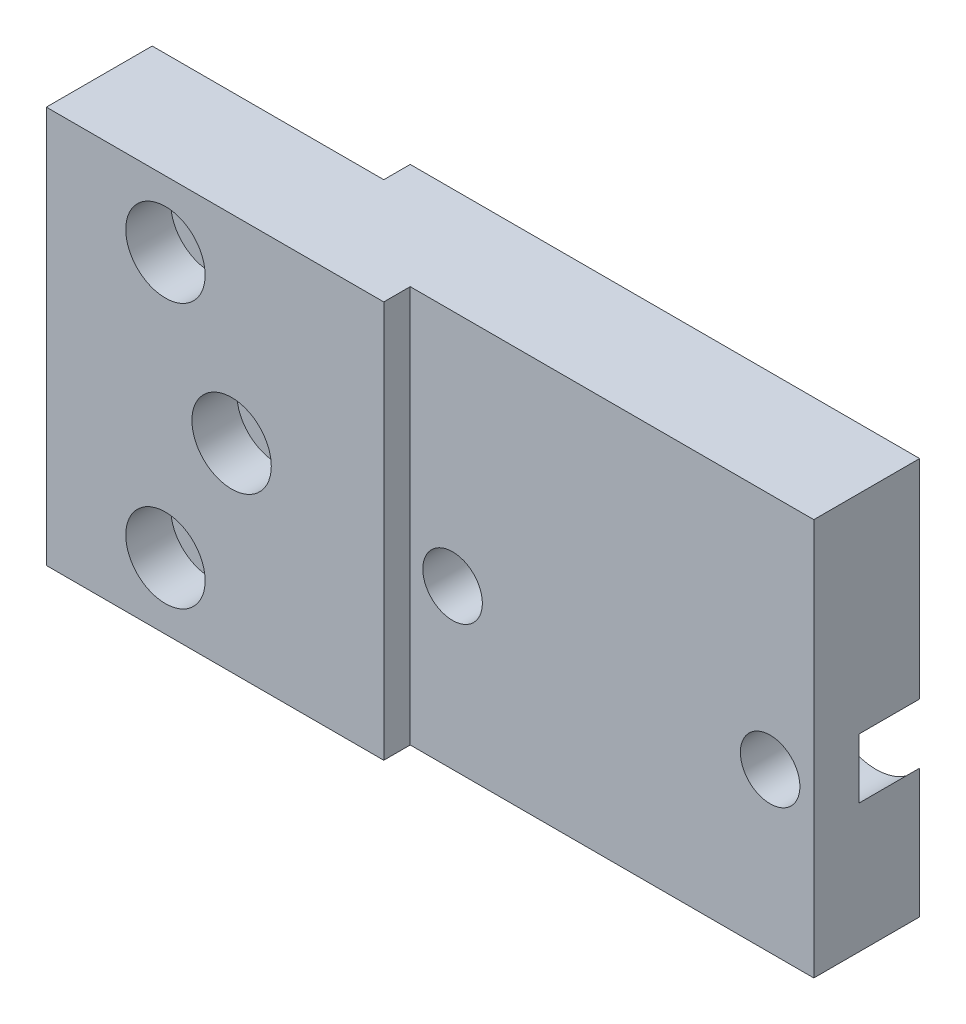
ISO-10303-21;
HEADER;
FILE_DESCRIPTION(('STEP AP214'),'2;1');
FILE_NAME('part.step','',(''),(''),'','','');
FILE_SCHEMA(('AUTOMOTIVE_DESIGN { 1 0 10303 214 1 1 1 1 }'));
ENDSEC;
DATA;
#1=APPLICATION_CONTEXT('core data for automotive mechanical design processes');
#2=APPLICATION_PROTOCOL_DEFINITION('international standard','automotive_design',2000,#1);
#3=PRODUCT_CONTEXT('',#1,'mechanical');
#4=PRODUCT('Part','Part','',(#3));
#5=PRODUCT_RELATED_PRODUCT_CATEGORY('part','',(#4));
#6=PRODUCT_DEFINITION_FORMATION('','',#4);
#7=PRODUCT_DEFINITION_CONTEXT('part definition',#1,'design');
#8=PRODUCT_DEFINITION('design','',#6,#7);
#9=PRODUCT_DEFINITION_SHAPE('','',#8);
#10=(LENGTH_UNIT() NAMED_UNIT(*) SI_UNIT(.MILLI.,.METRE.));
#11=(NAMED_UNIT(*) PLANE_ANGLE_UNIT() SI_UNIT($,.RADIAN.));
#12=(NAMED_UNIT(*) SI_UNIT($,.STERADIAN.) SOLID_ANGLE_UNIT());
#13=UNCERTAINTY_MEASURE_WITH_UNIT(LENGTH_MEASURE(1.E-05),#10,'distance_accuracy_value','');
#14=(GEOMETRIC_REPRESENTATION_CONTEXT(3) GLOBAL_UNCERTAINTY_ASSIGNED_CONTEXT((#13)) GLOBAL_UNIT_ASSIGNED_CONTEXT((#10,
#11,#12)) REPRESENTATION_CONTEXT('',''));
#15=CARTESIAN_POINT('',(0.,0.,0.));
#16=DIRECTION('',(0.,0.,1.));
#17=DIRECTION('',(1.,0.,0.));
#18=AXIS2_PLACEMENT_3D('',#15,#16,#17);
#19=CARTESIAN_POINT('',(-3.2,-15.,10.));
#20=DIRECTION('',(1.,0.,0.));
#21=DIRECTION('',(0.,0.,-1.));
#22=AXIS2_PLACEMENT_3D('',#19,#20,#21);
#23=PLANE('',#22);
#24=DIRECTION('',(0.,0.,-1.));
#25=VECTOR('',#24,1.);
#26=CARTESIAN_POINT('',(-3.2,15.,10.));
#27=LINE('',#26,#25);
#28=CARTESIAN_POINT('',(-3.2,15.,10.));
#29=VERTEX_POINT('',#28);
#30=CARTESIAN_POINT('',(-3.2,15.,2.));
#31=VERTEX_POINT('',#30);
#32=EDGE_CURVE('E200',#29,#31,#27,.T.);
#33=ORIENTED_EDGE('',*,*,#32,.T.);
#34=DIRECTION('',(0.,1.,0.));
#35=VECTOR('',#34,1.);
#36=CARTESIAN_POINT('',(-3.2,-15.,2.));
#37=LINE('',#36,#35);
#38=CARTESIAN_POINT('',(-3.2,-15.,2.));
#39=VERTEX_POINT('',#38);
#40=EDGE_CURVE('E180',#39,#31,#37,.T.);
#41=ORIENTED_EDGE('',*,*,#40,.F.);
#42=DIRECTION('',(0.,0.,-1.));
#43=VECTOR('',#42,1.);
#44=CARTESIAN_POINT('',(-3.2,-15.,10.));
#45=LINE('',#44,#43);
#46=CARTESIAN_POINT('',(-3.2,-15.,10.));
#47=VERTEX_POINT('',#46);
#48=EDGE_CURVE('E215',#47,#39,#45,.T.);
#49=ORIENTED_EDGE('',*,*,#48,.F.);
#50=DIRECTION('',(0.,-1.,0.));
#51=VECTOR('',#50,1.);
#52=CARTESIAN_POINT('',(-3.2,-15.,10.));
#53=LINE('',#52,#51);
#54=EDGE_CURVE('E192',#29,#47,#53,.T.);
#55=ORIENTED_EDGE('',*,*,#54,.F.);
#56=EDGE_LOOP('',(#33,#41,#49,#55));
#57=FACE_BOUND('',#56,.T.);
#58=ADVANCED_FACE('F16',(#57),#23,.F.);
#59=CARTESIAN_POINT('',(-3.2,-15.,10.));
#60=DIRECTION('',(0.,1.,0.));
#61=DIRECTION('',(0.,0.,1.));
#62=AXIS2_PLACEMENT_3D('',#59,#60,#61);
#63=PLANE('',#62);
#64=DIRECTION('',(0.,0.,-1.));
#65=VECTOR('',#64,1.);
#66=CARTESIAN_POINT('',(52.8,-15.,10.));
#67=LINE('',#66,#65);
#68=CARTESIAN_POINT('',(52.8,-15.,8.));
#69=VERTEX_POINT('',#68);
#70=CARTESIAN_POINT('',(52.8,-15.,0.));
#71=VERTEX_POINT('',#70);
#72=EDGE_CURVE('E213',#69,#71,#67,.T.);
#73=ORIENTED_EDGE('',*,*,#72,.F.);
#74=DIRECTION('',(1.,0.,0.));
#75=VECTOR('',#74,1.);
#76=CARTESIAN_POINT('',(52.8,-15.,8.));
#77=LINE('',#76,#75);
#78=CARTESIAN_POINT('',(22.3,-15.,8.));
#79=VERTEX_POINT('',#78);
#80=EDGE_CURVE('E114',#79,#69,#77,.T.);
#81=ORIENTED_EDGE('',*,*,#80,.F.);
#82=DIRECTION('',(0.,0.,-1.));
#83=VECTOR('',#82,1.);
#84=CARTESIAN_POINT('',(22.3,-15.,10.));
#85=LINE('',#84,#83);
#86=CARTESIAN_POINT('',(22.3,-15.,10.));
#87=VERTEX_POINT('',#86);
#88=EDGE_CURVE('E96',#87,#79,#85,.T.);
#89=ORIENTED_EDGE('',*,*,#88,.F.);
#90=DIRECTION('',(1.,0.,0.));
#91=VECTOR('',#90,1.);
#92=CARTESIAN_POINT('',(-3.2,-15.,10.));
#93=LINE('',#92,#91);
#94=EDGE_CURVE('E195',#47,#87,#93,.T.);
#95=ORIENTED_EDGE('',*,*,#94,.F.);
#96=ORIENTED_EDGE('',*,*,#48,.T.);
#97=DIRECTION('',(1.,0.,0.));
#98=VECTOR('',#97,1.);
#99=CARTESIAN_POINT('',(-3.2,-15.,2.));
#100=LINE('',#99,#98);
#101=CARTESIAN_POINT('',(14.3,-15.,2.));
#102=VERTEX_POINT('',#101);
#103=EDGE_CURVE('E173',#39,#102,#100,.T.);
#104=ORIENTED_EDGE('',*,*,#103,.T.);
#105=DIRECTION('',(0.,0.,-1.));
#106=VECTOR('',#105,1.);
#107=CARTESIAN_POINT('',(14.3,-15.,0.));
#108=LINE('',#107,#106);
#109=CARTESIAN_POINT('',(14.3,-15.,0.));
#110=VERTEX_POINT('',#109);
#111=EDGE_CURVE('E176',#102,#110,#108,.T.);
#112=ORIENTED_EDGE('',*,*,#111,.T.);
#113=DIRECTION('',(1.,0.,0.));
#114=VECTOR('',#113,1.);
#115=CARTESIAN_POINT('',(-3.2,-15.,0.));
#116=LINE('',#115,#114);
#117=EDGE_CURVE('E188',#110,#71,#116,.T.);
#118=ORIENTED_EDGE('',*,*,#117,.T.);
#119=EDGE_LOOP('',(#73,#81,#89,#95,#96,#104,#112,#118));
#120=FACE_BOUND('',#119,.T.);
#121=ADVANCED_FACE('F238',(#120),#63,.F.);
#122=CARTESIAN_POINT('',(52.8,-15.,10.));
#123=DIRECTION('',(-1.,0.,0.));
#124=DIRECTION('',(0.,0.,1.));
#125=AXIS2_PLACEMENT_3D('',#122,#123,#124);
#126=PLANE('',#125);
#127=DIRECTION('',(0.,0.,-1.));
#128=VECTOR('',#127,1.);
#129=CARTESIAN_POINT('',(52.8,15.,10.));
#130=LINE('',#129,#128);
#131=CARTESIAN_POINT('',(52.8,15.,8.));
#132=VERTEX_POINT('',#131);
#133=CARTESIAN_POINT('',(52.8,15.,0.));
#134=VERTEX_POINT('',#133);
#135=EDGE_CURVE('E211',#132,#134,#130,.T.);
#136=ORIENTED_EDGE('',*,*,#135,.F.);
#137=DIRECTION('',(0.,-1.,0.));
#138=VECTOR('',#137,1.);
#139=CARTESIAN_POINT('',(52.8,15.,8.));
#140=LINE('',#139,#138);
#141=EDGE_CURVE('E99',#132,#69,#140,.T.);
#142=ORIENTED_EDGE('',*,*,#141,.T.);
#143=ORIENTED_EDGE('',*,*,#72,.T.);
#144=DIRECTION('',(0.,1.,0.));
#145=VECTOR('',#144,1.);
#146=CARTESIAN_POINT('',(52.8,-15.,0.));
#147=LINE('',#146,#145);
#148=CARTESIAN_POINT('',(52.8,-5.26053091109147,0.));
#149=VERTEX_POINT('',#148);
#150=EDGE_CURVE('E204',#71,#149,#147,.T.);
#151=ORIENTED_EDGE('',*,*,#150,.T.);
#152=DIRECTION('',(0.,0.,-1.));
#153=VECTOR('',#152,1.);
#154=CARTESIAN_POINT('',(52.8,-5.26053091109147,0.));
#155=LINE('',#154,#153);
#156=CARTESIAN_POINT('',(52.8,-5.26053091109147,4.6));
#157=VERTEX_POINT('',#156);
#158=EDGE_CURVE('E39',#149,#157,#155,.F.);
#159=ORIENTED_EDGE('',*,*,#158,.T.);
#160=DIRECTION('',(0.,1.,0.));
#161=VECTOR('',#160,1.);
#162=CARTESIAN_POINT('',(52.8,-15.,4.6));
#163=LINE('',#162,#161);
#164=CARTESIAN_POINT('',(52.8,-0.73946908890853,4.6));
#165=VERTEX_POINT('',#164);
#166=EDGE_CURVE('E11',#157,#165,#163,.T.);
#167=ORIENTED_EDGE('',*,*,#166,.T.);
#168=DIRECTION('',(0.,0.,-1.));
#169=VECTOR('',#168,1.);
#170=CARTESIAN_POINT('',(52.8,-0.739469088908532,0.));
#171=LINE('',#170,#169);
#172=CARTESIAN_POINT('',(52.8,-0.739469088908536,0.));
#173=VERTEX_POINT('',#172);
#174=EDGE_CURVE('E140',#165,#173,#171,.T.);
#175=ORIENTED_EDGE('',*,*,#174,.T.);
#176=EDGE_CURVE('E203',#173,#134,#147,.T.);
#177=ORIENTED_EDGE('',*,*,#176,.T.);
#178=EDGE_LOOP('',(#136,#142,#143,#151,#159,#167,#175,#177));
#179=FACE_BOUND('',#178,.T.);
#180=ADVANCED_FACE('F230',(#179),#126,.F.);
#181=CARTESIAN_POINT('',(-3.2,15.,10.));
#182=DIRECTION('',(0.,-1.,0.));
#183=DIRECTION('',(0.,0.,-1.));
#184=AXIS2_PLACEMENT_3D('',#181,#182,#183);
#185=PLANE('',#184);
#186=DIRECTION('',(0.,0.,-1.));
#187=VECTOR('',#186,1.);
#188=CARTESIAN_POINT('',(22.3,15.,10.));
#189=LINE('',#188,#187);
#190=CARTESIAN_POINT('',(22.3,15.,10.));
#191=VERTEX_POINT('',#190);
#192=CARTESIAN_POINT('',(22.3,15.,8.));
#193=VERTEX_POINT('',#192);
#194=EDGE_CURVE('E31',#191,#193,#189,.T.);
#195=ORIENTED_EDGE('',*,*,#194,.T.);
#196=DIRECTION('',(1.,0.,0.));
#197=VECTOR('',#196,1.);
#198=CARTESIAN_POINT('',(52.8,15.,8.));
#199=LINE('',#198,#197);
#200=EDGE_CURVE('E103',#193,#132,#199,.T.);
#201=ORIENTED_EDGE('',*,*,#200,.T.);
#202=ORIENTED_EDGE('',*,*,#135,.T.);
#203=DIRECTION('',(-1.,0.,0.));
#204=VECTOR('',#203,1.);
#205=CARTESIAN_POINT('',(-3.2,15.,0.));
#206=LINE('',#205,#204);
#207=CARTESIAN_POINT('',(14.3,15.,0.));
#208=VERTEX_POINT('',#207);
#209=EDGE_CURVE('E196',#134,#208,#206,.T.);
#210=ORIENTED_EDGE('',*,*,#209,.T.);
#211=DIRECTION('',(0.,0.,-1.));
#212=VECTOR('',#211,1.);
#213=CARTESIAN_POINT('',(14.3,15.,0.));
#214=LINE('',#213,#212);
#215=CARTESIAN_POINT('',(14.3,15.,2.));
#216=VERTEX_POINT('',#215);
#217=EDGE_CURVE('E177',#216,#208,#214,.T.);
#218=ORIENTED_EDGE('',*,*,#217,.F.);
#219=DIRECTION('',(1.,0.,0.));
#220=VECTOR('',#219,1.);
#221=CARTESIAN_POINT('',(-3.2,15.,2.));
#222=LINE('',#221,#220);
#223=EDGE_CURVE('E181',#31,#216,#222,.T.);
#224=ORIENTED_EDGE('',*,*,#223,.F.);
#225=ORIENTED_EDGE('',*,*,#32,.F.);
#226=DIRECTION('',(-1.,0.,0.));
#227=VECTOR('',#226,1.);
#228=CARTESIAN_POINT('',(-3.2,15.,10.));
#229=LINE('',#228,#227);
#230=EDGE_CURVE('E113',#191,#29,#229,.T.);
#231=ORIENTED_EDGE('',*,*,#230,.F.);
#232=EDGE_LOOP('',(#195,#201,#202,#210,#218,#224,#225,#231));
#233=FACE_BOUND('',#232,.T.);
#234=ADVANCED_FACE('F111',(#233),#185,.F.);
#235=CARTESIAN_POINT('',(0.,0.,10.));
#236=DIRECTION('',(0.,0.,-1.));
#237=DIRECTION('',(-1.,0.,0.));
#238=AXIS2_PLACEMENT_3D('',#235,#236,#237);
#239=PLANE('',#238);
#240=CARTESIAN_POINT('',(5.8,10.,10.));
#241=DIRECTION('',(0.,0.,1.));
#242=DIRECTION('',(1.,0.,0.));
#243=AXIS2_PLACEMENT_3D('',#240,#241,#242);
#244=CIRCLE('',#243,3.);
#245=CARTESIAN_POINT('',(8.8,10.,10.));
#246=VERTEX_POINT('',#245);
#247=EDGE_CURVE('E143',#246,#246,#244,.T.);
#248=ORIENTED_EDGE('',*,*,#247,.F.);
#249=EDGE_LOOP('',(#248));
#250=FACE_BOUND('',#249,.T.);
#251=CARTESIAN_POINT('',(10.8,0.,10.));
#252=DIRECTION('',(0.,0.,1.));
#253=DIRECTION('',(1.,0.,0.));
#254=AXIS2_PLACEMENT_3D('',#251,#252,#253);
#255=CIRCLE('',#254,3.);
#256=CARTESIAN_POINT('',(13.8,0.,10.));
#257=VERTEX_POINT('',#256);
#258=EDGE_CURVE('E153',#257,#257,#255,.T.);
#259=ORIENTED_EDGE('',*,*,#258,.F.);
#260=EDGE_LOOP('',(#259));
#261=FACE_BOUND('',#260,.T.);
#262=CARTESIAN_POINT('',(5.8,-10.,10.));
#263=DIRECTION('',(0.,0.,1.));
#264=DIRECTION('',(1.,0.,0.));
#265=AXIS2_PLACEMENT_3D('',#262,#263,#264);
#266=CIRCLE('',#265,3.);
#267=CARTESIAN_POINT('',(8.8,-10.,10.));
#268=VERTEX_POINT('',#267);
#269=EDGE_CURVE('E163',#268,#268,#266,.T.);
#270=ORIENTED_EDGE('',*,*,#269,.F.);
#271=EDGE_LOOP('',(#270));
#272=FACE_BOUND('',#271,.T.);
#273=ORIENTED_EDGE('',*,*,#94,.T.);
#274=DIRECTION('',(0.,-1.,0.));
#275=VECTOR('',#274,1.);
#276=CARTESIAN_POINT('',(22.3,15.,10.));
#277=LINE('',#276,#275);
#278=EDGE_CURVE('E100',#191,#87,#277,.T.);
#279=ORIENTED_EDGE('',*,*,#278,.F.);
#280=ORIENTED_EDGE('',*,*,#230,.T.);
#281=ORIENTED_EDGE('',*,*,#54,.T.);
#282=EDGE_LOOP('',(#273,#279,#280,#281));
#283=FACE_BOUND('',#282,.T.);
#284=ADVANCED_FACE('F249',(#250,#261,#272,#283),#239,.F.);
#285=CARTESIAN_POINT('',(0.,0.,0.));
#286=DIRECTION('',(0.,0.,-1.));
#287=DIRECTION('',(-1.,0.,0.));
#288=AXIS2_PLACEMENT_3D('',#285,#286,#287);
#289=PLANE('',#288);
#290=CARTESIAN_POINT('',(25.5,-3.,0.));
#291=DIRECTION('',(0.,0.,-1.));
#292=DIRECTION('',(-1.,0.,0.));
#293=AXIS2_PLACEMENT_3D('',#290,#291,#292);
#294=CIRCLE('',#293,4.);
#295=CARTESIAN_POINT('',(21.5,-3.,0.));
#296=VERTEX_POINT('',#295);
#297=EDGE_CURVE('E124',#296,#296,#294,.T.);
#298=ORIENTED_EDGE('',*,*,#297,.F.);
#299=EDGE_LOOP('',(#298));
#300=FACE_BOUND('',#299,.T.);
#301=CARTESIAN_POINT('',(49.5,-3.,0.));
#302=DIRECTION('',(0.,0.,-1.));
#303=DIRECTION('',(-1.,0.,0.));
#304=AXIS2_PLACEMENT_3D('',#301,#302,#303);
#305=CIRCLE('',#304,4.);
#306=EDGE_CURVE('E24',#149,#173,#305,.T.);
#307=ORIENTED_EDGE('',*,*,#306,.F.);
#308=ORIENTED_EDGE('',*,*,#150,.F.);
#309=ORIENTED_EDGE('',*,*,#117,.F.);
#310=DIRECTION('',(0.,1.,0.));
#311=VECTOR('',#310,1.);
#312=CARTESIAN_POINT('',(14.3,-15.,0.));
#313=LINE('',#312,#311);
#314=EDGE_CURVE('E185',#110,#208,#313,.T.);
#315=ORIENTED_EDGE('',*,*,#314,.T.);
#316=ORIENTED_EDGE('',*,*,#209,.F.);
#317=ORIENTED_EDGE('',*,*,#176,.F.);
#318=EDGE_LOOP('',(#307,#308,#309,#315,#316,#317));
#319=FACE_BOUND('',#318,.T.);
#320=ADVANCED_FACE('F232',(#300,#319),#289,.T.);
#321=CARTESIAN_POINT('',(14.3,-15.,0.));
#322=DIRECTION('',(1.,0.,0.));
#323=DIRECTION('',(0.,0.,-1.));
#324=AXIS2_PLACEMENT_3D('',#321,#322,#323);
#325=PLANE('',#324);
#326=ORIENTED_EDGE('',*,*,#217,.T.);
#327=ORIENTED_EDGE('',*,*,#314,.F.);
#328=ORIENTED_EDGE('',*,*,#111,.F.);
#329=DIRECTION('',(0.,1.,0.));
#330=VECTOR('',#329,1.);
#331=CARTESIAN_POINT('',(14.3,-15.,2.));
#332=LINE('',#331,#330);
#333=EDGE_CURVE('E189',#102,#216,#332,.T.);
#334=ORIENTED_EDGE('',*,*,#333,.T.);
#335=EDGE_LOOP('',(#326,#327,#328,#334));
#336=FACE_BOUND('',#335,.T.);
#337=ADVANCED_FACE('F241',(#336),#325,.F.);
#338=CARTESIAN_POINT('',(-3.2,-15.,2.));
#339=DIRECTION('',(0.,0.,1.));
#340=DIRECTION('',(1.,0.,0.));
#341=AXIS2_PLACEMENT_3D('',#338,#339,#340);
#342=PLANE('',#341);
#343=CARTESIAN_POINT('',(5.8,10.,2.));
#344=DIRECTION('',(0.,0.,1.));
#345=DIRECTION('',(1.,0.,0.));
#346=AXIS2_PLACEMENT_3D('',#343,#344,#345);
#347=CIRCLE('',#346,1.7);
#348=CARTESIAN_POINT('',(7.5,10.,2.));
#349=VERTEX_POINT('',#348);
#350=EDGE_CURVE('E152',#349,#349,#347,.T.);
#351=ORIENTED_EDGE('',*,*,#350,.T.);
#352=EDGE_LOOP('',(#351));
#353=FACE_BOUND('',#352,.T.);
#354=CARTESIAN_POINT('',(10.8,0.,2.));
#355=DIRECTION('',(0.,0.,1.));
#356=DIRECTION('',(1.,0.,0.));
#357=AXIS2_PLACEMENT_3D('',#354,#355,#356);
#358=CIRCLE('',#357,1.7);
#359=CARTESIAN_POINT('',(12.5,0.,2.));
#360=VERTEX_POINT('',#359);
#361=EDGE_CURVE('E162',#360,#360,#358,.T.);
#362=ORIENTED_EDGE('',*,*,#361,.T.);
#363=EDGE_LOOP('',(#362));
#364=FACE_BOUND('',#363,.T.);
#365=CARTESIAN_POINT('',(5.8,-10.,2.));
#366=DIRECTION('',(0.,0.,1.));
#367=DIRECTION('',(1.,0.,0.));
#368=AXIS2_PLACEMENT_3D('',#365,#366,#367);
#369=CIRCLE('',#368,1.7);
#370=CARTESIAN_POINT('',(7.5,-10.,2.));
#371=VERTEX_POINT('',#370);
#372=EDGE_CURVE('E172',#371,#371,#369,.T.);
#373=ORIENTED_EDGE('',*,*,#372,.T.);
#374=EDGE_LOOP('',(#373));
#375=FACE_BOUND('',#374,.T.);
#376=ORIENTED_EDGE('',*,*,#223,.T.);
#377=ORIENTED_EDGE('',*,*,#333,.F.);
#378=ORIENTED_EDGE('',*,*,#103,.F.);
#379=ORIENTED_EDGE('',*,*,#40,.T.);
#380=EDGE_LOOP('',(#376,#377,#378,#379));
#381=FACE_BOUND('',#380,.T.);
#382=ADVANCED_FACE('F243',(#353,#364,#375,#381),#342,.F.);
#383=CARTESIAN_POINT('',(5.8,-10.,10.));
#384=DIRECTION('',(0.,0.,1.));
#385=DIRECTION('',(1.,0.,0.));
#386=AXIS2_PLACEMENT_3D('',#383,#384,#385);
#387=CYLINDRICAL_SURFACE('',#386,1.7);
#388=CARTESIAN_POINT('',(5.8,-10.,6.6));
#389=DIRECTION('',(0.,0.,1.));
#390=DIRECTION('',(1.,0.,0.));
#391=AXIS2_PLACEMENT_3D('',#388,#389,#390);
#392=CIRCLE('',#391,1.7);
#393=CARTESIAN_POINT('',(7.5,-10.,6.6));
#394=VERTEX_POINT('',#393);
#395=EDGE_CURVE('E169',#394,#394,#392,.T.);
#396=ORIENTED_EDGE('',*,*,#395,.T.);
#397=EDGE_LOOP('',(#396));
#398=FACE_BOUND('',#397,.T.);
#399=ORIENTED_EDGE('',*,*,#372,.F.);
#400=EDGE_LOOP('',(#399));
#401=FACE_BOUND('',#400,.T.);
#402=ADVANCED_FACE('F315',(#398,#401),#387,.F.);
#403=CARTESIAN_POINT('',(7.5,-10.,6.6));
#404=DIRECTION('',(0.,0.,-1.));
#405=DIRECTION('',(-1.,0.,0.));
#406=AXIS2_PLACEMENT_3D('',#403,#404,#405);
#407=PLANE('',#406);
#408=ORIENTED_EDGE('',*,*,#395,.F.);
#409=EDGE_LOOP('',(#408));
#410=FACE_BOUND('',#409,.T.);
#411=CARTESIAN_POINT('',(5.8,-10.,6.6));
#412=DIRECTION('',(0.,0.,1.));
#413=DIRECTION('',(1.,0.,0.));
#414=AXIS2_PLACEMENT_3D('',#411,#412,#413);
#415=CIRCLE('',#414,3.);
#416=CARTESIAN_POINT('',(8.8,-10.,6.6));
#417=VERTEX_POINT('',#416);
#418=EDGE_CURVE('E166',#417,#417,#415,.T.);
#419=ORIENTED_EDGE('',*,*,#418,.T.);
#420=EDGE_LOOP('',(#419));
#421=FACE_BOUND('',#420,.T.);
#422=ADVANCED_FACE('F323',(#410,#421),#407,.F.);
#423=CARTESIAN_POINT('',(5.8,-10.,10.));
#424=DIRECTION('',(0.,0.,1.));
#425=DIRECTION('',(1.,0.,0.));
#426=AXIS2_PLACEMENT_3D('',#423,#424,#425);
#427=CYLINDRICAL_SURFACE('',#426,3.);
#428=ORIENTED_EDGE('',*,*,#418,.F.);
#429=EDGE_LOOP('',(#428));
#430=FACE_BOUND('',#429,.T.);
#431=ORIENTED_EDGE('',*,*,#269,.T.);
#432=EDGE_LOOP('',(#431));
#433=FACE_BOUND('',#432,.T.);
#434=ADVANCED_FACE('F333',(#430,#433),#427,.F.);
#435=CARTESIAN_POINT('',(10.8,0.,10.));
#436=DIRECTION('',(0.,0.,1.));
#437=DIRECTION('',(1.,0.,0.));
#438=AXIS2_PLACEMENT_3D('',#435,#436,#437);
#439=CYLINDRICAL_SURFACE('',#438,1.7);
#440=CARTESIAN_POINT('',(10.8,0.,6.6));
#441=DIRECTION('',(0.,0.,1.));
#442=DIRECTION('',(1.,0.,0.));
#443=AXIS2_PLACEMENT_3D('',#440,#441,#442);
#444=CIRCLE('',#443,1.7);
#445=CARTESIAN_POINT('',(12.5,0.,6.6));
#446=VERTEX_POINT('',#445);
#447=EDGE_CURVE('E159',#446,#446,#444,.T.);
#448=ORIENTED_EDGE('',*,*,#447,.T.);
#449=EDGE_LOOP('',(#448));
#450=FACE_BOUND('',#449,.T.);
#451=ORIENTED_EDGE('',*,*,#361,.F.);
#452=EDGE_LOOP('',(#451));
#453=FACE_BOUND('',#452,.T.);
#454=ADVANCED_FACE('F343',(#450,#453),#439,.F.);
#455=CARTESIAN_POINT('',(12.5,0.,6.6));
#456=DIRECTION('',(0.,0.,-1.));
#457=DIRECTION('',(-1.,0.,0.));
#458=AXIS2_PLACEMENT_3D('',#455,#456,#457);
#459=PLANE('',#458);
#460=ORIENTED_EDGE('',*,*,#447,.F.);
#461=EDGE_LOOP('',(#460));
#462=FACE_BOUND('',#461,.T.);
#463=CARTESIAN_POINT('',(10.8,0.,6.6));
#464=DIRECTION('',(0.,0.,1.));
#465=DIRECTION('',(1.,0.,0.));
#466=AXIS2_PLACEMENT_3D('',#463,#464,#465);
#467=CIRCLE('',#466,3.);
#468=CARTESIAN_POINT('',(13.8,0.,6.6));
#469=VERTEX_POINT('',#468);
#470=EDGE_CURVE('E156',#469,#469,#467,.T.);
#471=ORIENTED_EDGE('',*,*,#470,.T.);
#472=EDGE_LOOP('',(#471));
#473=FACE_BOUND('',#472,.T.);
#474=ADVANCED_FACE('F353',(#462,#473),#459,.F.);
#475=CARTESIAN_POINT('',(10.8,0.,10.));
#476=DIRECTION('',(0.,0.,1.));
#477=DIRECTION('',(1.,0.,0.));
#478=AXIS2_PLACEMENT_3D('',#475,#476,#477);
#479=CYLINDRICAL_SURFACE('',#478,3.);
#480=ORIENTED_EDGE('',*,*,#470,.F.);
#481=EDGE_LOOP('',(#480));
#482=FACE_BOUND('',#481,.T.);
#483=ORIENTED_EDGE('',*,*,#258,.T.);
#484=EDGE_LOOP('',(#483));
#485=FACE_BOUND('',#484,.T.);
#486=ADVANCED_FACE('F363',(#482,#485),#479,.F.);
#487=CARTESIAN_POINT('',(5.8,10.,10.));
#488=DIRECTION('',(0.,0.,1.));
#489=DIRECTION('',(1.,0.,0.));
#490=AXIS2_PLACEMENT_3D('',#487,#488,#489);
#491=CYLINDRICAL_SURFACE('',#490,1.7);
#492=CARTESIAN_POINT('',(5.8,10.,6.6));
#493=DIRECTION('',(0.,0.,1.));
#494=DIRECTION('',(1.,0.,0.));
#495=AXIS2_PLACEMENT_3D('',#492,#493,#494);
#496=CIRCLE('',#495,1.7);
#497=CARTESIAN_POINT('',(7.5,10.,6.6));
#498=VERTEX_POINT('',#497);
#499=EDGE_CURVE('E149',#498,#498,#496,.T.);
#500=ORIENTED_EDGE('',*,*,#499,.T.);
#501=EDGE_LOOP('',(#500));
#502=FACE_BOUND('',#501,.T.);
#503=ORIENTED_EDGE('',*,*,#350,.F.);
#504=EDGE_LOOP('',(#503));
#505=FACE_BOUND('',#504,.T.);
#506=ADVANCED_FACE('F373',(#502,#505),#491,.F.);
#507=CARTESIAN_POINT('',(7.5,10.,6.6));
#508=DIRECTION('',(0.,0.,-1.));
#509=DIRECTION('',(-1.,0.,0.));
#510=AXIS2_PLACEMENT_3D('',#507,#508,#509);
#511=PLANE('',#510);
#512=ORIENTED_EDGE('',*,*,#499,.F.);
#513=EDGE_LOOP('',(#512));
#514=FACE_BOUND('',#513,.T.);
#515=CARTESIAN_POINT('',(5.8,10.,6.6));
#516=DIRECTION('',(0.,0.,1.));
#517=DIRECTION('',(1.,0.,0.));
#518=AXIS2_PLACEMENT_3D('',#515,#516,#517);
#519=CIRCLE('',#518,3.);
#520=CARTESIAN_POINT('',(8.8,10.,6.6));
#521=VERTEX_POINT('',#520);
#522=EDGE_CURVE('E146',#521,#521,#519,.T.);
#523=ORIENTED_EDGE('',*,*,#522,.T.);
#524=EDGE_LOOP('',(#523));
#525=FACE_BOUND('',#524,.T.);
#526=ADVANCED_FACE('F383',(#514,#525),#511,.F.);
#527=CARTESIAN_POINT('',(5.8,10.,10.));
#528=DIRECTION('',(0.,0.,1.));
#529=DIRECTION('',(1.,0.,0.));
#530=AXIS2_PLACEMENT_3D('',#527,#528,#529);
#531=CYLINDRICAL_SURFACE('',#530,3.);
#532=ORIENTED_EDGE('',*,*,#522,.F.);
#533=EDGE_LOOP('',(#532));
#534=FACE_BOUND('',#533,.T.);
#535=ORIENTED_EDGE('',*,*,#247,.T.);
#536=EDGE_LOOP('',(#535));
#537=FACE_BOUND('',#536,.T.);
#538=ADVANCED_FACE('F393',(#534,#537),#531,.F.);
#539=CARTESIAN_POINT('',(51.75,-3.,4.6));
#540=DIRECTION('',(0.,0.,1.));
#541=DIRECTION('',(1.,0.,0.));
#542=AXIS2_PLACEMENT_3D('',#539,#540,#541);
#543=PLANE('',#542);
#544=CARTESIAN_POINT('',(49.5,-3.,4.6));
#545=DIRECTION('',(0.,0.,-1.));
#546=DIRECTION('',(-1.,0.,0.));
#547=AXIS2_PLACEMENT_3D('',#544,#545,#546);
#548=CIRCLE('',#547,2.25);
#549=CARTESIAN_POINT('',(47.25,-3.,4.6));
#550=VERTEX_POINT('',#549);
#551=EDGE_CURVE('E136',#550,#550,#548,.T.);
#552=ORIENTED_EDGE('',*,*,#551,.F.);
#553=EDGE_LOOP('',(#552));
#554=FACE_BOUND('',#553,.T.);
#555=CARTESIAN_POINT('',(49.5,-3.,4.6));
#556=DIRECTION('',(0.,0.,-1.));
#557=DIRECTION('',(-1.,0.,0.));
#558=AXIS2_PLACEMENT_3D('',#555,#556,#557);
#559=CIRCLE('',#558,4.);
#560=EDGE_CURVE('E133',#157,#165,#559,.T.);
#561=ORIENTED_EDGE('',*,*,#560,.T.);
#562=ORIENTED_EDGE('',*,*,#166,.F.);
#563=EDGE_LOOP('',(#561,#562));
#564=FACE_BOUND('',#563,.T.);
#565=ADVANCED_FACE('F403',(#554,#564),#543,.F.);
#566=CARTESIAN_POINT('',(49.5,-3.,0.));
#567=DIRECTION('',(0.,0.,-1.));
#568=DIRECTION('',(-1.,0.,0.));
#569=AXIS2_PLACEMENT_3D('',#566,#567,#568);
#570=CYLINDRICAL_SURFACE('',#569,4.);
#571=ORIENTED_EDGE('',*,*,#560,.F.);
#572=ORIENTED_EDGE('',*,*,#158,.F.);
#573=ORIENTED_EDGE('',*,*,#306,.T.);
#574=ORIENTED_EDGE('',*,*,#174,.F.);
#575=EDGE_LOOP('',(#571,#572,#573,#574));
#576=FACE_BOUND('',#575,.T.);
#577=ADVANCED_FACE('F224',(#576),#570,.F.);
#578=CARTESIAN_POINT('',(49.5,-3.,0.));
#579=DIRECTION('',(0.,0.,-1.));
#580=DIRECTION('',(-1.,0.,0.));
#581=AXIS2_PLACEMENT_3D('',#578,#579,#580);
#582=CYLINDRICAL_SURFACE('',#581,2.25);
#583=CARTESIAN_POINT('',(49.5,-3.,8.));
#584=DIRECTION('',(0.,0.,-1.));
#585=DIRECTION('',(-1.,0.,0.));
#586=AXIS2_PLACEMENT_3D('',#583,#584,#585);
#587=CIRCLE('',#586,2.25);
#588=CARTESIAN_POINT('',(47.25,-3.,8.));
#589=VERTEX_POINT('',#588);
#590=EDGE_CURVE('E121',#589,#589,#587,.F.);
#591=ORIENTED_EDGE('',*,*,#590,.T.);
#592=EDGE_LOOP('',(#591));
#593=FACE_BOUND('',#592,.T.);
#594=ORIENTED_EDGE('',*,*,#551,.T.);
#595=EDGE_LOOP('',(#594));
#596=FACE_BOUND('',#595,.T.);
#597=ADVANCED_FACE('F422',(#593,#596),#582,.F.);
#598=CARTESIAN_POINT('',(25.5,-3.,0.));
#599=DIRECTION('',(0.,0.,-1.));
#600=DIRECTION('',(-1.,0.,0.));
#601=AXIS2_PLACEMENT_3D('',#598,#599,#600);
#602=CYLINDRICAL_SURFACE('',#601,2.25);
#603=CARTESIAN_POINT('',(25.5,-3.,8.));
#604=DIRECTION('',(0.,0.,-1.));
#605=DIRECTION('',(-1.,0.,0.));
#606=AXIS2_PLACEMENT_3D('',#603,#604,#605);
#607=CIRCLE('',#606,2.25);
#608=CARTESIAN_POINT('',(23.25,-3.,8.));
#609=VERTEX_POINT('',#608);
#610=EDGE_CURVE('E19',#609,#609,#607,.F.);
#611=ORIENTED_EDGE('',*,*,#610,.T.);
#612=EDGE_LOOP('',(#611));
#613=FACE_BOUND('',#612,.T.);
#614=CARTESIAN_POINT('',(25.5,-3.,4.6));
#615=DIRECTION('',(0.,0.,-1.));
#616=DIRECTION('',(-1.,0.,0.));
#617=AXIS2_PLACEMENT_3D('',#614,#615,#616);
#618=CIRCLE('',#617,2.25);
#619=CARTESIAN_POINT('',(23.25,-3.,4.6));
#620=VERTEX_POINT('',#619);
#621=EDGE_CURVE('E130',#620,#620,#618,.T.);
#622=ORIENTED_EDGE('',*,*,#621,.T.);
#623=EDGE_LOOP('',(#622));
#624=FACE_BOUND('',#623,.T.);
#625=ADVANCED_FACE('F432',(#613,#624),#602,.F.);
#626=CARTESIAN_POINT('',(27.75,-3.,4.6));
#627=DIRECTION('',(0.,0.,1.));
#628=DIRECTION('',(1.,0.,0.));
#629=AXIS2_PLACEMENT_3D('',#626,#627,#628);
#630=PLANE('',#629);
#631=ORIENTED_EDGE('',*,*,#621,.F.);
#632=EDGE_LOOP('',(#631));
#633=FACE_BOUND('',#632,.T.);
#634=CARTESIAN_POINT('',(25.5,-3.,4.6));
#635=DIRECTION('',(0.,0.,-1.));
#636=DIRECTION('',(-1.,0.,0.));
#637=AXIS2_PLACEMENT_3D('',#634,#635,#636);
#638=CIRCLE('',#637,4.);
#639=CARTESIAN_POINT('',(21.5,-3.,4.6));
#640=VERTEX_POINT('',#639);
#641=EDGE_CURVE('E127',#640,#640,#638,.T.);
#642=ORIENTED_EDGE('',*,*,#641,.T.);
#643=EDGE_LOOP('',(#642));
#644=FACE_BOUND('',#643,.T.);
#645=ADVANCED_FACE('F442',(#633,#644),#630,.F.);
#646=CARTESIAN_POINT('',(25.5,-3.,0.));
#647=DIRECTION('',(0.,0.,-1.));
#648=DIRECTION('',(-1.,0.,0.));
#649=AXIS2_PLACEMENT_3D('',#646,#647,#648);
#650=CYLINDRICAL_SURFACE('',#649,4.);
#651=ORIENTED_EDGE('',*,*,#641,.F.);
#652=EDGE_LOOP('',(#651));
#653=FACE_BOUND('',#652,.T.);
#654=ORIENTED_EDGE('',*,*,#297,.T.);
#655=EDGE_LOOP('',(#654));
#656=FACE_BOUND('',#655,.T.);
#657=ADVANCED_FACE('F452',(#653,#656),#650,.F.);
#658=CARTESIAN_POINT('',(52.8,15.,8.));
#659=DIRECTION('',(0.,0.,-1.));
#660=DIRECTION('',(-1.,0.,0.));
#661=AXIS2_PLACEMENT_3D('',#658,#659,#660);
#662=PLANE('',#661);
#663=ORIENTED_EDGE('',*,*,#610,.F.);
#664=EDGE_LOOP('',(#663));
#665=FACE_BOUND('',#664,.T.);
#666=ORIENTED_EDGE('',*,*,#80,.T.);
#667=ORIENTED_EDGE('',*,*,#141,.F.);
#668=ORIENTED_EDGE('',*,*,#200,.F.);
#669=DIRECTION('',(0.,-1.,0.));
#670=VECTOR('',#669,1.);
#671=CARTESIAN_POINT('',(22.3,15.,8.));
#672=LINE('',#671,#670);
#673=EDGE_CURVE('E92',#193,#79,#672,.T.);
#674=ORIENTED_EDGE('',*,*,#673,.T.);
#675=EDGE_LOOP('',(#666,#667,#668,#674));
#676=FACE_BOUND('',#675,.T.);
#677=ORIENTED_EDGE('',*,*,#590,.F.);
#678=EDGE_LOOP('',(#677));
#679=FACE_BOUND('',#678,.T.);
#680=ADVANCED_FACE('F104',(#665,#676,#679),#662,.F.);
#681=CARTESIAN_POINT('',(22.3,15.,10.));
#682=DIRECTION('',(-1.,0.,0.));
#683=DIRECTION('',(0.,0.,1.));
#684=AXIS2_PLACEMENT_3D('',#681,#682,#683);
#685=PLANE('',#684);
#686=ORIENTED_EDGE('',*,*,#88,.T.);
#687=ORIENTED_EDGE('',*,*,#673,.F.);
#688=ORIENTED_EDGE('',*,*,#194,.F.);
#689=ORIENTED_EDGE('',*,*,#278,.T.);
#690=EDGE_LOOP('',(#686,#687,#688,#689));
#691=FACE_BOUND('',#690,.T.);
#692=ADVANCED_FACE('F94',(#691),#685,.F.);
#693=CLOSED_SHELL('',(#58,#121,#180,#234,#284,#320,#337,#382,#402,#422,#434,#454,#474,#486,#506,
#526,#538,#565,#577,#597,#625,#645,#657,#680,#692));
#694=MANIFOLD_SOLID_BREP('B1',#693);
#695=ADVANCED_BREP_SHAPE_REPRESENTATION('',(#18,#694),#14);
#696=SHAPE_DEFINITION_REPRESENTATION(#9,#695);
ENDSEC;
END-ISO-10303-21;
